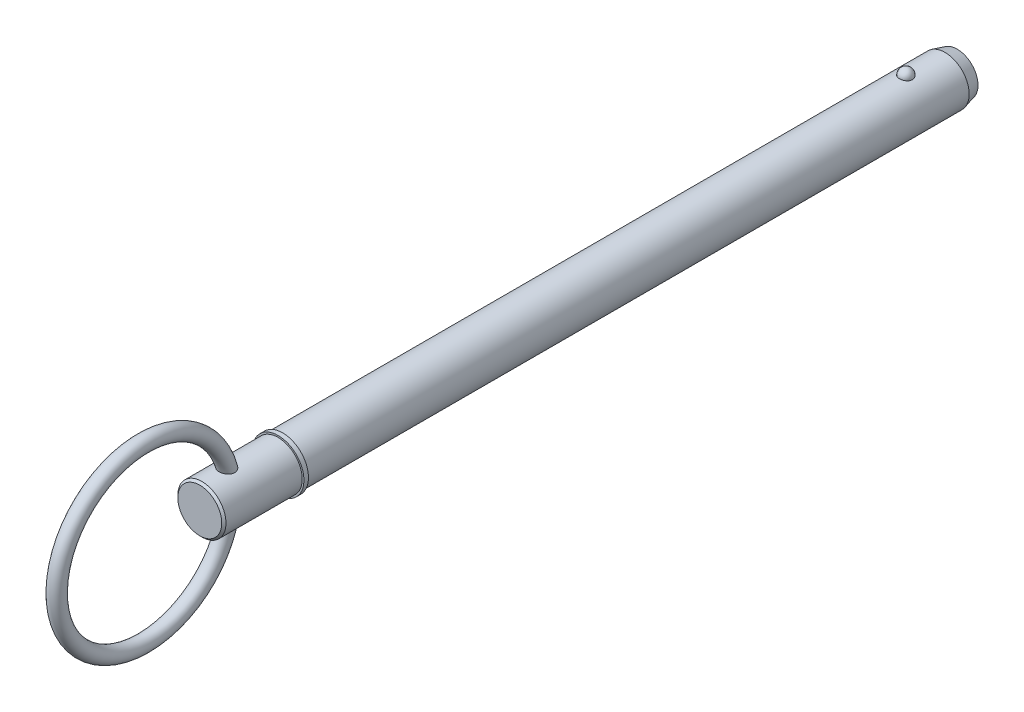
ISO-10303-21;
HEADER;
FILE_DESCRIPTION(('STEP AP214'),'2;1');
FILE_NAME('part.step','',(''),(''),'','','');
FILE_SCHEMA(('AUTOMOTIVE_DESIGN { 1 0 10303 214 1 1 1 1 }'));
ENDSEC;
DATA;
#1=APPLICATION_CONTEXT('core data for automotive mechanical design processes');
#2=APPLICATION_PROTOCOL_DEFINITION('international standard','automotive_design',2000,#1);
#3=PRODUCT_CONTEXT('',#1,'mechanical');
#4=PRODUCT('Part','Part','',(#3));
#5=PRODUCT_RELATED_PRODUCT_CATEGORY('part','',(#4));
#6=PRODUCT_DEFINITION_FORMATION('','',#4);
#7=PRODUCT_DEFINITION_CONTEXT('part definition',#1,'design');
#8=PRODUCT_DEFINITION('design','',#6,#7);
#9=PRODUCT_DEFINITION_SHAPE('','',#8);
#10=(LENGTH_UNIT() NAMED_UNIT(*) SI_UNIT(.MILLI.,.METRE.));
#11=(NAMED_UNIT(*) PLANE_ANGLE_UNIT() SI_UNIT($,.RADIAN.));
#12=(NAMED_UNIT(*) SI_UNIT($,.STERADIAN.) SOLID_ANGLE_UNIT());
#13=UNCERTAINTY_MEASURE_WITH_UNIT(LENGTH_MEASURE(1.E-05),#10,'distance_accuracy_value','');
#14=(GEOMETRIC_REPRESENTATION_CONTEXT(3) GLOBAL_UNCERTAINTY_ASSIGNED_CONTEXT((#13)) GLOBAL_UNIT_ASSIGNED_CONTEXT((#10,
#11,#12)) REPRESENTATION_CONTEXT('',''));
#15=CARTESIAN_POINT('',(0.,0.,0.));
#16=DIRECTION('',(0.,0.,1.));
#17=DIRECTION('',(1.,0.,0.));
#18=AXIS2_PLACEMENT_3D('',#15,#16,#17);
#19=CARTESIAN_POINT('',(0.,0.,203.2));
#20=DIRECTION('',(0.,0.,-1.));
#21=DIRECTION('',(-1.,0.,0.));
#22=AXIS2_PLACEMENT_3D('',#19,#20,#21);
#23=CYLINDRICAL_SURFACE('',#22,7.94);
#24=CARTESIAN_POINT('',(2.13020349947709,7.64891057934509,-2.14999999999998));
#25=CARTESIAN_POINT('',(2.1302012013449,7.64891247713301,-2.02978166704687));
#26=CARTESIAN_POINT('',(2.12037546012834,7.65166842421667,-1.90953383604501));
#27=CARTESIAN_POINT('',(2.08130792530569,7.66238579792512,-1.67243962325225));
#28=CARTESIAN_POINT('',(2.05205785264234,7.67034944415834,-1.55559471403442));
#29=CARTESIAN_POINT('',(1.97489181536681,7.69057749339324,-1.32869361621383));
#30=CARTESIAN_POINT('',(1.92698409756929,7.70283999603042,-1.218634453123));
#31=CARTESIAN_POINT('',(1.81370645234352,7.73029430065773,-1.00831338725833));
#32=CARTESIAN_POINT('',(1.74833715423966,7.7454859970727,-0.908051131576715));
#33=CARTESIAN_POINT('',(1.60144242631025,7.77718699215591,-0.719628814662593));
#34=CARTESIAN_POINT('',(1.51984382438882,7.7937020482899,-0.631526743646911));
#35=CARTESIAN_POINT('',(1.34279837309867,7.82614685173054,-0.470411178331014));
#36=CARTESIAN_POINT('',(1.24735148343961,7.84207659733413,-0.397397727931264));
#37=CARTESIAN_POINT('',(1.04544839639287,7.87153116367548,-0.268681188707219));
#38=CARTESIAN_POINT('',(0.939022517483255,7.88506234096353,-0.212932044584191));
#39=CARTESIAN_POINT('',(0.717931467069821,7.90825597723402,-0.120080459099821));
#40=CARTESIAN_POINT('',(0.603267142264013,7.9179188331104,-0.0829761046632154));
#41=CARTESIAN_POINT('',(0.371015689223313,7.93216561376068,-0.0289596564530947));
#42=CARTESIAN_POINT('',(0.253510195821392,7.93683225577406,-0.0117183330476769));
#43=CARTESIAN_POINT('',(0.0171784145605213,7.94086051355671,0.00318921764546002));
#44=CARTESIAN_POINT('',(-0.101647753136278,7.94022260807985,0.000857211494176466));
#45=CARTESIAN_POINT('',(-0.335567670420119,7.93375751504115,-0.0231465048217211));
#46=CARTESIAN_POINT('',(-0.450690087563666,7.92799987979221,-0.0445590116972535));
#47=CARTESIAN_POINT('',(-0.675610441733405,7.91200792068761,-0.105760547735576));
#48=CARTESIAN_POINT('',(-0.785408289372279,7.90177352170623,-0.145549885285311));
#49=CARTESIAN_POINT('',(-0.9972706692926,7.87784802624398,-0.242675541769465));
#50=CARTESIAN_POINT('',(-1.0992893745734,7.86413823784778,-0.300107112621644));
#51=CARTESIAN_POINT('',(-1.29223659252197,7.83474718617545,-0.430887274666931));
#52=CARTESIAN_POINT('',(-1.38316404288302,7.81906573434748,-0.50423738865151));
#53=CARTESIAN_POINT('',(-1.55313516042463,7.78710451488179,-0.666358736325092));
#54=CARTESIAN_POINT('',(-1.63193689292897,7.77081906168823,-0.755382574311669));
#55=CARTESIAN_POINT('',(-1.77366356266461,7.73970270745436,-0.945507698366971));
#56=CARTESIAN_POINT('',(-1.83658745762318,7.72487190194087,-1.04660977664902));
#57=CARTESIAN_POINT('',(-1.94556640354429,7.6981535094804,-1.2592768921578));
#58=CARTESIAN_POINT('',(-1.99143480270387,7.6862989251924,-1.37094182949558));
#59=CARTESIAN_POINT('',(-2.06418311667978,7.66708387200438,-1.6006615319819));
#60=CARTESIAN_POINT('',(-2.0910635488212,7.65972328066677,-1.71871612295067));
#61=CARTESIAN_POINT('',(-2.12508507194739,7.65035479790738,-1.95736076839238));
#62=CARTESIAN_POINT('',(-2.13230490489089,7.64832555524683,-2.07793875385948));
#63=CARTESIAN_POINT('',(-2.12704767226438,7.64978921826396,-2.31862835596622));
#64=CARTESIAN_POINT('',(-2.1145710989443,7.6532819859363,-2.4387399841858));
#65=CARTESIAN_POINT('',(-2.07034166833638,7.66536368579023,-2.6745168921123));
#66=CARTESIAN_POINT('',(-2.03867758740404,7.67392914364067,-2.79020005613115));
#67=CARTESIAN_POINT('',(-1.95694065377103,7.69517736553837,-3.014466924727));
#68=CARTESIAN_POINT('',(-1.90686710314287,7.70786028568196,-3.12305035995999));
#69=CARTESIAN_POINT('',(-1.78925555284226,7.73600831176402,-3.33065971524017));
#70=CARTESIAN_POINT('',(-1.72162904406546,7.75148739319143,-3.42963360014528));
#71=CARTESIAN_POINT('',(-1.57074739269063,7.78346215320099,-3.61466914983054));
#72=CARTESIAN_POINT('',(-1.48749169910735,7.79995786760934,-3.70073035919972));
#73=CARTESIAN_POINT('',(-1.30720250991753,7.83219119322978,-3.85783594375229));
#74=CARTESIAN_POINT('',(-1.2101234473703,7.84792605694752,-3.92882863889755));
#75=CARTESIAN_POINT('',(-1.00503150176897,7.87681523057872,-4.05342383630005));
#76=CARTESIAN_POINT('',(-0.897019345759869,7.88996971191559,-4.10702749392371));
#77=CARTESIAN_POINT('',(-0.674439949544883,7.91208451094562,-4.1947773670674));
#78=CARTESIAN_POINT('',(-0.55996501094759,7.92109245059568,-4.22914554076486));
#79=CARTESIAN_POINT('',(-0.326625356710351,7.93413878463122,-4.27838865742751));
#80=CARTESIAN_POINT('',(-0.20776113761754,7.93817773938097,-4.29326579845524));
#81=CARTESIAN_POINT('',(0.0287357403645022,7.94081322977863,-4.30300621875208));
#82=CARTESIAN_POINT('',(0.14635312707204,7.93950453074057,-4.2982179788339));
#83=CARTESIAN_POINT('',(0.379062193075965,7.93180098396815,-4.26955229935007));
#84=CARTESIAN_POINT('',(0.494153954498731,7.92540630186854,-4.24567548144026));
#85=CARTESIAN_POINT('',(0.718185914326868,7.90824874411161,-4.17962260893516));
#86=CARTESIAN_POINT('',(0.827145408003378,7.89750055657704,-4.13750805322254));
#87=CARTESIAN_POINT('',(1.03638036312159,7.87277755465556,-4.03615078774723));
#88=CARTESIAN_POINT('',(1.13665531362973,7.85880255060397,-3.97690707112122));
#89=CARTESIAN_POINT('',(1.32729731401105,7.82887859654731,-3.84189297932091));
#90=CARTESIAN_POINT('',(1.41749828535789,7.81290379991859,-3.76589388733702));
#91=CARTESIAN_POINT('',(1.58397257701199,7.78086330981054,-3.59992466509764));
#92=CARTESIAN_POINT('',(1.66024342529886,7.76479760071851,-3.50995206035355));
#93=CARTESIAN_POINT('',(1.79805631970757,7.73405928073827,-3.31688321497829));
#94=CARTESIAN_POINT('',(1.85933944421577,7.719413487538,-3.21359780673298));
#95=CARTESIAN_POINT('',(1.96397499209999,7.69345992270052,-2.99796163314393));
#96=CARTESIAN_POINT('',(2.00733488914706,7.68215076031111,-2.88561466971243));
#97=CARTESIAN_POINT('',(2.07068045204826,7.66529896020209,-2.66994136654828));
#98=CARTESIAN_POINT('',(2.09296296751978,7.65919990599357,-2.56732606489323));
#99=CARTESIAN_POINT('',(2.12272535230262,7.65100492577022,-2.35981463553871));
#100=CARTESIAN_POINT('',(2.13020550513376,7.64890892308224,-2.25491855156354));
#101=CARTESIAN_POINT('',(2.13020349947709,7.64891057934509,-2.14999999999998));
#102=B_SPLINE_CURVE_WITH_KNOTS('',3,(#24,#25,#26,#27,#28,#29,#30,#31,#32,#33,#34,#35,#36,#37,
#38,#39,#40,#41,#42,#43,#44,#45,#46,#47,#48,#49,#50,#51,#52,#53,#54,#55,#56,#57,#58,#59,#60,#61,
#62,#63,#64,#65,#66,#67,#68,#69,#70,#71,#72,#73,#74,#75,#76,#77,#78,#79,#80,#81,#82,#83,#84,#85,
#86,#87,#88,#89,#90,#91,#92,#93,#94,#95,#96,#97,#98,#99,#100,#101),.UNSPECIFIED.,.T.,.F.,(4,2,2,
2,2,2,2,2,2,2,2,2,2,2,2,2,2,2,2,2,2,2,2,2,2,2,2,2,2,2,2,2,2,2,2,2,2,2,4),(0.,0.360277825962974,
0.720709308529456,1.0809816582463,1.44124102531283,1.80316307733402,2.16508618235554,
2.52603531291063,2.88694740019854,3.24178717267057,3.59659491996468,3.94665496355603,
4.29672088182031,4.64871108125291,5.0007349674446,5.3590619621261,5.71741247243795,
6.079576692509,6.44173104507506,6.80243279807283,7.16312553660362,7.52216203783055,
7.88121215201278,8.24210915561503,8.60301888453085,8.96514709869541,9.32725124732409,
9.68508606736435,10.0428805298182,10.3943622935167,10.7458326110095,11.0961268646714,
11.4464417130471,11.8018724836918,12.1573662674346,12.5186252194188,12.8797333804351,
13.1941658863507,13.5085923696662),.UNSPECIFIED.);
#103=CARTESIAN_POINT('',(2.13020349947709,7.64891057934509,-2.14999999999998));
#104=VERTEX_POINT('',#103);
#105=EDGE_CURVE('E102',#104,#104,#102,.T.);
#106=ORIENTED_EDGE('',*,*,#105,.T.);
#107=EDGE_LOOP('',(#106));
#108=FACE_BOUND('',#107,.T.);
#109=CARTESIAN_POINT('',(0.,0.,-15.0499999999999));
#110=DIRECTION('',(0.,0.,-1.));
#111=DIRECTION('',(-1.,0.,0.));
#112=AXIS2_PLACEMENT_3D('',#109,#110,#111);
#113=CIRCLE('',#112,7.94);
#114=CARTESIAN_POINT('',(-7.94,0.,-15.0499999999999));
#115=VERTEX_POINT('',#114);
#116=EDGE_CURVE('E110',#115,#115,#113,.F.);
#117=ORIENTED_EDGE('',*,*,#116,.T.);
#118=EDGE_LOOP('',(#117));
#119=FACE_BOUND('',#118,.T.);
#120=CARTESIAN_POINT('',(0.,0.,203.2));
#121=DIRECTION('',(0.,0.,1.));
#122=DIRECTION('',(1.,0.,0.));
#123=AXIS2_PLACEMENT_3D('',#120,#121,#122);
#124=CIRCLE('',#123,7.94);
#125=CARTESIAN_POINT('',(7.94,0.,203.2));
#126=VERTEX_POINT('',#125);
#127=EDGE_CURVE('E108',#126,#126,#124,.T.);
#128=ORIENTED_EDGE('',*,*,#127,.F.);
#129=EDGE_LOOP('',(#128));
#130=FACE_BOUND('',#129,.T.);
#131=ADVANCED_FACE('F39',(#108,#119,#130),#23,.T.);
#132=CARTESIAN_POINT('',(0.,0.,-19.05));
#133=DIRECTION('',(0.,0.,-1.));
#134=DIRECTION('',(-1.,0.,0.));
#135=AXIS2_PLACEMENT_3D('',#132,#133,#134);
#136=PLANE('',#135);
#137=CARTESIAN_POINT('',(0.,0.,-19.05));
#138=DIRECTION('',(0.,0.,-1.));
#139=DIRECTION('',(-1.,0.,0.));
#140=AXIS2_PLACEMENT_3D('',#137,#138,#139);
#141=CIRCLE('',#140,6.8682032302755);
#142=CARTESIAN_POINT('',(-6.8682032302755,0.,-19.05));
#143=VERTEX_POINT('',#142);
#144=EDGE_CURVE('E142',#143,#143,#141,.T.);
#145=ORIENTED_EDGE('',*,*,#144,.T.);
#146=EDGE_LOOP('',(#145));
#147=FACE_BOUND('',#146,.T.);
#148=ADVANCED_FACE('F88',(#147),#136,.T.);
#149=CARTESIAN_POINT('',(0.,0.,-19.05));
#150=DIRECTION('',(0.,0.,1.));
#151=DIRECTION('',(1.,0.,0.));
#152=AXIS2_PLACEMENT_3D('',#149,#150,#151);
#153=CONICAL_SURFACE('',#152,6.8682032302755,0.261799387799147);
#154=ORIENTED_EDGE('',*,*,#116,.F.);
#155=EDGE_LOOP('',(#154));
#156=FACE_BOUND('',#155,.T.);
#157=ORIENTED_EDGE('',*,*,#144,.F.);
#158=EDGE_LOOP('',(#157));
#159=FACE_BOUND('',#158,.T.);
#160=ADVANCED_FACE('F94',(#156,#159),#153,.T.);
#161=CARTESIAN_POINT('',(0.,7.94,-2.14999999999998));
#162=DIRECTION('',(0.,1.,0.));
#163=DIRECTION('',(0.,0.,-1.));
#164=AXIS2_PLACEMENT_3D('',#161,#162,#163);
#165=SPHERICAL_SURFACE('',#164,2.15);
#166=ORIENTED_EDGE('',*,*,#105,.F.);
#167=EDGE_LOOP('',(#166));
#168=FACE_BOUND('',#167,.T.);
#169=ADVANCED_FACE('F113',(#168),#165,.T.);
#170=CARTESIAN_POINT('',(0.,0.,203.2));
#171=DIRECTION('',(0.,0.,-1.));
#172=DIRECTION('',(-1.,0.,0.));
#173=AXIS2_PLACEMENT_3D('',#170,#171,#172);
#174=PLANE('',#173);
#175=ORIENTED_EDGE('',*,*,#127,.T.);
#176=EDGE_LOOP('',(#175));
#177=FACE_BOUND('',#176,.T.);
#178=CARTESIAN_POINT('',(0.,0.,203.2));
#179=DIRECTION('',(0.,0.,-1.));
#180=DIRECTION('',(-1.,0.,0.));
#181=AXIS2_PLACEMENT_3D('',#178,#179,#180);
#182=CIRCLE('',#181,8.5);
#183=CARTESIAN_POINT('',(-8.5,0.,203.2));
#184=VERTEX_POINT('',#183);
#185=EDGE_CURVE('E109',#184,#184,#182,.T.);
#186=ORIENTED_EDGE('',*,*,#185,.T.);
#187=EDGE_LOOP('',(#186));
#188=FACE_BOUND('',#187,.T.);
#189=ADVANCED_FACE('F117',(#177,#188),#174,.T.);
#190=CARTESIAN_POINT('',(0.,0.,33.7287874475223));
#191=DIRECTION('',(0.,0.,-1.));
#192=DIRECTION('',(-1.,0.,0.));
#193=AXIS2_PLACEMENT_3D('',#190,#191,#192);
#194=CYLINDRICAL_SURFACE('',#193,8.5);
#195=CARTESIAN_POINT('',(0.,0.,204.7));
#196=DIRECTION('',(0.,0.,-1.));
#197=DIRECTION('',(-1.,0.,0.));
#198=AXIS2_PLACEMENT_3D('',#195,#196,#197);
#199=CIRCLE('',#198,8.5);
#200=CARTESIAN_POINT('',(-8.5,0.,204.7));
#201=VERTEX_POINT('',#200);
#202=EDGE_CURVE('E134',#201,#201,#199,.T.);
#203=ORIENTED_EDGE('',*,*,#202,.T.);
#204=EDGE_LOOP('',(#203));
#205=FACE_BOUND('',#204,.T.);
#206=ORIENTED_EDGE('',*,*,#185,.F.);
#207=EDGE_LOOP('',(#206));
#208=FACE_BOUND('',#207,.T.);
#209=ADVANCED_FACE('F121',(#205,#208),#194,.T.);
#210=CARTESIAN_POINT('',(0.,8.5,204.7));
#211=DIRECTION('',(0.,0.,1.));
#212=DIRECTION('',(1.,0.,0.));
#213=AXIS2_PLACEMENT_3D('',#210,#211,#212);
#214=PLANE('',#213);
#215=CARTESIAN_POINT('',(0.,0.,204.7));
#216=DIRECTION('',(0.,0.,1.));
#217=DIRECTION('',(1.,0.,0.));
#218=AXIS2_PLACEMENT_3D('',#215,#216,#217);
#219=CIRCLE('',#218,7.94);
#220=CARTESIAN_POINT('',(7.94,0.,204.7));
#221=VERTEX_POINT('',#220);
#222=EDGE_CURVE('E112',#221,#221,#219,.T.);
#223=ORIENTED_EDGE('',*,*,#222,.F.);
#224=EDGE_LOOP('',(#223));
#225=FACE_BOUND('',#224,.T.);
#226=ORIENTED_EDGE('',*,*,#202,.F.);
#227=EDGE_LOOP('',(#226));
#228=FACE_BOUND('',#227,.T.);
#229=ADVANCED_FACE('F85',(#225,#228),#214,.T.);
#230=CARTESIAN_POINT('',(0.,0.,230.51));
#231=DIRECTION('',(0.,0.,-1.));
#232=DIRECTION('',(-1.,0.,0.));
#233=AXIS2_PLACEMENT_3D('',#230,#231,#232);
#234=CYLINDRICAL_SURFACE('',#233,7.94);
#235=CARTESIAN_POINT('',(-1.15544091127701,-7.85547938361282,219.311910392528));
#236=CARTESIAN_POINT('',(-1.03089695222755,-7.87379554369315,219.249615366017));
#237=CARTESIAN_POINT('',(-0.900845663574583,-7.8898743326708,219.197593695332));
#238=CARTESIAN_POINT('',(-0.633417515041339,-7.91583465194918,219.115265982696));
#239=CARTESIAN_POINT('',(-0.496037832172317,-7.92571377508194,219.084968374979));
#240=CARTESIAN_POINT('',(-0.217881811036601,-7.93823020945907,219.046773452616));
#241=CARTESIAN_POINT('',(-0.0771057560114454,-7.94086812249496,219.038874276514));
#242=CARTESIAN_POINT('',(0.203828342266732,-7.93862624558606,219.045648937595));
#243=CARTESIAN_POINT('',(0.343986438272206,-7.93374711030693,219.060320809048));
#244=CARTESIAN_POINT('',(0.619544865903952,-7.9169944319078,219.111877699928));
#245=CARTESIAN_POINT('',(0.754950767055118,-7.9051293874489,219.148735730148));
#246=CARTESIAN_POINT('',(1.01737529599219,-7.8756583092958,219.243842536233));
#247=CARTESIAN_POINT('',(1.14439334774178,-7.85805188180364,219.302092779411));
#248=CARTESIAN_POINT('',(1.38668443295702,-7.81893907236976,219.438842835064));
#249=CARTESIAN_POINT('',(1.50193494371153,-7.79742542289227,219.517380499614));
#250=CARTESIAN_POINT('',(1.71711272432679,-7.75288428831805,219.692872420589));
#251=CARTESIAN_POINT('',(1.81704089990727,-7.72985689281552,219.789825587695));
#252=CARTESIAN_POINT('',(1.99787261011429,-7.68509802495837,219.99887149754));
#253=CARTESIAN_POINT('',(2.07893183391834,-7.66335713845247,220.110827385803));
#254=CARTESIAN_POINT('',(2.2207658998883,-7.62346723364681,220.347480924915));
#255=CARTESIAN_POINT('',(2.28154607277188,-7.6053172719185,220.472175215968));
#256=CARTESIAN_POINT('',(2.38011540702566,-7.57504217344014,220.727618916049));
#257=CARTESIAN_POINT('',(2.41840843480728,-7.56278621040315,220.858158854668));
#258=CARTESIAN_POINT('',(2.47363993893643,-7.54490265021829,221.124095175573));
#259=CARTESIAN_POINT('',(2.49057788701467,-7.53927521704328,221.259491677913));
#260=CARTESIAN_POINT('',(2.50351014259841,-7.53499042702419,221.53242871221));
#261=CARTESIAN_POINT('',(2.49933630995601,-7.53638902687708,221.669977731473));
#262=CARTESIAN_POINT('',(2.47072547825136,-7.54581524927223,221.942698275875));
#263=CARTESIAN_POINT('',(2.44628184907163,-7.55384504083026,222.077869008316));
#264=CARTESIAN_POINT('',(2.37589315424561,-7.57629160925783,222.353085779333));
#265=CARTESIAN_POINT('',(2.32844094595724,-7.5911515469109,222.49270896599));
#266=CARTESIAN_POINT('',(2.21332780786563,-7.62550828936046,222.762781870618));
#267=CARTESIAN_POINT('',(2.14565489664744,-7.64500784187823,222.893226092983));
#268=CARTESIAN_POINT('',(1.98438755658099,-7.68852412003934,223.153702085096));
#269=CARTESIAN_POINT('',(1.88896913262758,-7.71279219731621,223.282569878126));
#270=CARTESIAN_POINT('',(1.67743245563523,-7.7615471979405,223.522112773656));
#271=CARTESIAN_POINT('',(1.56130644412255,-7.78603420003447,223.632781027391));
#272=CARTESIAN_POINT('',(1.31168281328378,-7.83191501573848,223.830100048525));
#273=CARTESIAN_POINT('',(1.1784163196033,-7.85334315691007,223.917029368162));
#274=CARTESIAN_POINT('',(0.967442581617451,-7.88116219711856,224.026657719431));
#275=CARTESIAN_POINT('',(0.895283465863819,-7.88971376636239,224.059736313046));
#276=CARTESIAN_POINT('',(0.747777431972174,-7.90505596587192,224.118400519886));
#277=CARTESIAN_POINT('',(0.672431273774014,-7.91184701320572,224.143987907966));
#278=CARTESIAN_POINT('',(0.53057561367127,-7.92252382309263,224.183912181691));
#279=CARTESIAN_POINT('',(0.464394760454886,-7.92668987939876,224.199349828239));
#280=CARTESIAN_POINT('',(0.330815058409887,-7.9333870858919,224.224069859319));
#281=CARTESIAN_POINT('',(0.263416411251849,-7.93591850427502,224.23335325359));
#282=CARTESIAN_POINT('',(0.128041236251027,-7.93925585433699,224.245577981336));
#283=CARTESIAN_POINT('',(0.0600650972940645,-7.94006286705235,224.248523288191));
#284=CARTESIAN_POINT('',(-0.0758408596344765,-7.93992929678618,224.248033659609));
#285=CARTESIAN_POINT('',(-0.143770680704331,-7.93898884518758,224.244599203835));
#286=CARTESIAN_POINT('',(-0.330023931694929,-7.93402174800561,224.226406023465));
#287=CARTESIAN_POINT('',(-0.447720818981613,-7.92820264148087,224.205060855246));
#288=CARTESIAN_POINT('',(-0.677833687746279,-7.91185818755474,224.144093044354));
#289=CARTESIAN_POINT('',(-0.790248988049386,-7.90133223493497,224.104468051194));
#290=CARTESIAN_POINT('',(-1.01082100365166,-7.87620111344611,224.007436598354));
#291=CARTESIAN_POINT('',(-1.1187367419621,-7.86147932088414,223.949515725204));
#292=CARTESIAN_POINT('',(-1.32464461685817,-7.8294189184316,223.818755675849));
#293=CARTESIAN_POINT('',(-1.42263264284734,-7.81207923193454,223.745910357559));
#294=CARTESIAN_POINT('',(-1.62038324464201,-7.77363945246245,223.576536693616));
#295=CARTESIAN_POINT('',(-1.7184938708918,-7.75235190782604,223.478123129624));
#296=CARTESIAN_POINT('',(-1.89908721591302,-7.71010284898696,223.267783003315));
#297=CARTESIAN_POINT('',(-1.9815587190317,-7.68914157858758,223.155846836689));
#298=CARTESIAN_POINT('',(-2.13974270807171,-7.64674394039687,222.905108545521));
#299=CARTESIAN_POINT('',(-2.21304020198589,-7.62562536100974,222.764719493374));
#300=CARTESIAN_POINT('',(-2.33615659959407,-7.58881542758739,222.473266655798));
#301=CARTESIAN_POINT('',(-2.38596943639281,-7.57312547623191,222.322200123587));
#302=CARTESIAN_POINT('',(-2.46059473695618,-7.54921618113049,222.010492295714));
#303=CARTESIAN_POINT('',(-2.48494918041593,-7.54113395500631,221.849728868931));
#304=CARTESIAN_POINT('',(-2.50480773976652,-7.53456588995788,221.526244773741));
#305=CARTESIAN_POINT('',(-2.50033692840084,-7.53607171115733,221.363525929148));
#306=CARTESIAN_POINT('',(-2.46306926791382,-7.54832452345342,221.057165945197));
#307=CARTESIAN_POINT('',(-2.4329569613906,-7.55819528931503,220.913162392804));
#308=CARTESIAN_POINT('',(-2.34806892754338,-7.58499431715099,220.633304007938));
#309=CARTESIAN_POINT('',(-2.29330013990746,-7.60192059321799,220.497446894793));
#310=CARTESIAN_POINT('',(-2.16523724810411,-7.63933506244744,220.24765733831));
#311=CARTESIAN_POINT('',(-2.09353456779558,-7.65948502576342,220.132853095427));
#312=CARTESIAN_POINT('',(-1.93200913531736,-7.7018104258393,219.917268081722));
#313=CARTESIAN_POINT('',(-1.842192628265,-7.72398516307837,219.816482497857));
#314=CARTESIAN_POINT('',(-1.65746337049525,-7.76558957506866,219.64131484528));
#315=CARTESIAN_POINT('',(-1.56413624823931,-7.78505810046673,219.565259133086));
#316=CARTESIAN_POINT('',(-1.36706423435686,-7.82207051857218,219.42753576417));
#317=CARTESIAN_POINT('',(-1.26331856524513,-7.83961426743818,219.365869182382));
#318=CARTESIAN_POINT('',(-1.15544091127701,-7.85547938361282,219.311910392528));
#319=B_SPLINE_CURVE_WITH_KNOTS('',3,(#235,#236,#237,#238,#239,#240,#241,#242,#243,#244,#245,
#246,#247,#248,#249,#250,#251,#252,#253,#254,#255,#256,#257,#258,#259,#260,#261,#262,#263,#264,
#265,#266,#267,#268,#269,#270,#271,#272,#273,#274,#275,#276,#277,#278,#279,#280,#281,#282,#283,
#284,#285,#286,#287,#288,#289,#290,#291,#292,#293,#294,#295,#296,#297,#298,#299,#300,#301,#302,
#303,#304,#305,#306,#307,#308,#309,#310,#311,#312,#313,#314,#315,#316,#317,#318),.UNSPECIFIED.,
.T.,.F.,(4,2,2,2,2,2,2,2,2,2,2,2,2,2,2,2,2,2,2,2,2,2,2,2,2,2,2,2,2,2,2,2,2,2,2,2,2,2,2,2,2,4),
(0.,0.420927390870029,0.842018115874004,1.26307384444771,1.68409290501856,2.10460083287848,
2.52513760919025,2.94646475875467,3.36776699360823,3.7854589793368,4.20304108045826,
4.61086922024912,5.01870744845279,5.42979890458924,5.84102487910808,6.28383316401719,
6.72690434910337,7.21113455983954,7.6955465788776,8.17400305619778,8.41316278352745,
8.65226580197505,8.85622998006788,9.06016068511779,9.26396350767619,9.4677510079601,
9.8252104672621,10.1827159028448,10.5513335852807,10.9201032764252,11.3402098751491,
11.7606166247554,12.2377707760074,12.715048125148,13.2007716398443,13.6860727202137,
14.1260485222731,14.5659005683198,14.9745225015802,15.3830037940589,15.7475760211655,
16.1121754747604),.UNSPECIFIED.);
#320=CARTESIAN_POINT('',(-1.15544091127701,-7.85547938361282,219.311910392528));
#321=VERTEX_POINT('',#320);
#322=EDGE_CURVE('E10',#321,#321,#319,.T.);
#323=ORIENTED_EDGE('',*,*,#322,.F.);
#324=EDGE_LOOP('',(#323));
#325=FACE_BOUND('',#324,.T.);
#326=CARTESIAN_POINT('',(-1.15544091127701,7.85547938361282,219.311910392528));
#327=CARTESIAN_POINT('',(-1.278579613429,7.83736699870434,219.373507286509));
#328=CARTESIAN_POINT('',(-1.39638360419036,7.8170599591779,219.445172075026));
#329=CARTESIAN_POINT('',(-1.61803025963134,7.77421032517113,219.60708252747));
#330=CARTESIAN_POINT('',(-1.72186951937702,7.7516671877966,219.697332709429));
#331=CARTESIAN_POINT('',(-1.91269683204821,7.70680387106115,219.894395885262));
#332=CARTESIAN_POINT('',(-1.99967065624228,7.68448389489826,220.001222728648));
#333=CARTESIAN_POINT('',(-2.15412555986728,7.64262858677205,220.228607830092));
#334=CARTESIAN_POINT('',(-2.22161184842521,7.62309251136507,220.349162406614));
#335=CARTESIAN_POINT('',(-2.3342927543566,7.5893410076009,220.598377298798));
#336=CARTESIAN_POINT('',(-2.3798562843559,7.57503857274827,220.726859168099));
#337=CARTESIAN_POINT('',(-2.44955571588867,7.55278941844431,220.990011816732));
#338=CARTESIAN_POINT('',(-2.47369226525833,7.544842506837,221.12468240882));
#339=CARTESIAN_POINT('',(-2.50059611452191,7.53596831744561,221.396137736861));
#340=CARTESIAN_POINT('',(-2.50339277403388,7.53503139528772,221.532919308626));
#341=CARTESIAN_POINT('',(-2.48855779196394,7.53994222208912,221.805224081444));
#342=CARTESIAN_POINT('',(-2.47092012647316,7.54579197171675,221.94074689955));
#343=CARTESIAN_POINT('',(-2.41469361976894,7.56397908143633,222.216293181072));
#344=CARTESIAN_POINT('',(-2.37479606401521,7.57671999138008,222.35602135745));
#345=CARTESIAN_POINT('',(-2.27489955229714,7.60730881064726,222.627515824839));
#346=CARTESIAN_POINT('',(-2.2148900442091,7.6251594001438,222.759277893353));
#347=CARTESIAN_POINT('',(-2.06943931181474,7.66598084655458,223.02452508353));
#348=CARTESIAN_POINT('',(-1.98208275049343,7.68928197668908,223.156914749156));
#349=CARTESIAN_POINT('',(-1.78658869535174,7.73704343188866,223.405235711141));
#350=CARTESIAN_POINT('',(-1.67843905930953,7.76150442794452,223.521157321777));
#351=CARTESIAN_POINT('',(-1.44142605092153,7.80900750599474,223.733699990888));
#352=CARTESIAN_POINT('',(-1.31231821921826,7.83202775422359,223.830058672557));
#353=CARTESIAN_POINT('',(-1.10627655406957,7.86286215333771,223.954614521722));
#354=CARTESIAN_POINT('',(-1.03552563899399,7.87252500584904,223.992805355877));
#355=CARTESIAN_POINT('',(-0.890375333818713,7.89025728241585,224.061885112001));
#356=CARTESIAN_POINT('',(-0.815978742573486,7.89832790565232,224.092779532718));
#357=CARTESIAN_POINT('',(-0.674180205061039,7.91160332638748,224.143082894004));
#358=CARTESIAN_POINT('',(-0.607145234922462,7.91704543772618,224.163468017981));
#359=CARTESIAN_POINT('',(-0.471385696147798,7.92628663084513,224.197876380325));
#360=CARTESIAN_POINT('',(-0.402662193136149,7.93008672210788,224.211903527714));
#361=CARTESIAN_POINT('',(-0.264153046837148,7.9359070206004,224.233322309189));
#362=CARTESIAN_POINT('',(-0.194368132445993,7.9379283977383,224.240718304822));
#363=CARTESIAN_POINT('',(-0.0544054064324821,7.94012285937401,224.248743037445));
#364=CARTESIAN_POINT('',(0.0157723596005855,7.94029615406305,224.249372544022));
#365=CARTESIAN_POINT('',(0.206295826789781,7.93822912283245,224.241825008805));
#366=CARTESIAN_POINT('',(0.326425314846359,7.93416340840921,224.226989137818));
#367=CARTESIAN_POINT('',(0.562310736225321,7.92094769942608,224.178077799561));
#368=CARTESIAN_POINT('',(0.67806631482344,7.91179729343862,224.14400077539));
#369=CARTESIAN_POINT('',(0.903029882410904,7.88929555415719,224.058269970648));
#370=CARTESIAN_POINT('',(1.01220356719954,7.87592415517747,224.006532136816));
#371=CARTESIAN_POINT('',(1.22142047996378,7.84620431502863,223.887793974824));
#372=CARTESIAN_POINT('',(1.32146048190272,7.82985482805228,223.820788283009));
#373=CARTESIAN_POINT('',(1.52328754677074,7.7932678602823,223.664309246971));
#374=CARTESIAN_POINT('',(1.62365085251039,7.77280069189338,223.573056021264));
#375=CARTESIAN_POINT('',(1.80985117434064,7.73156849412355,223.376815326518));
#376=CARTESIAN_POINT('',(1.895678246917,7.71080327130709,223.27181854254));
#377=CARTESIAN_POINT('',(2.06302404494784,7.66785771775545,223.034543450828));
#378=CARTESIAN_POINT('',(2.14213178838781,7.64590590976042,222.900514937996));
#379=CARTESIAN_POINT('',(2.27825755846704,7.60645646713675,222.620994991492));
#380=CARTESIAN_POINT('',(2.33526577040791,7.58896081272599,222.475498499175));
#381=CARTESIAN_POINT('',(2.42707573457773,7.56011538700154,222.170242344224));
#382=CARTESIAN_POINT('',(2.4608459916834,7.54905411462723,222.010140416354));
#383=CARTESIAN_POINT('',(2.49980168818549,7.53624914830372,221.686129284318));
#384=CARTESIAN_POINT('',(2.50500938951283,7.5344981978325,221.522223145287));
#385=CARTESIAN_POINT('',(2.48594104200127,7.54080673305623,221.209976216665));
#386=CARTESIAN_POINT('',(2.46407777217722,7.54806351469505,221.061473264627));
#387=CARTESIAN_POINT('',(2.3945479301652,7.57040718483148,220.771258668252));
#388=CARTESIAN_POINT('',(2.34689355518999,7.58549037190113,220.629543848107));
#389=CARTESIAN_POINT('',(2.2318274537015,7.62009243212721,220.369141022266));
#390=CARTESIAN_POINT('',(2.16637710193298,7.63914093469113,220.249517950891));
#391=CARTESIAN_POINT('',(2.01638736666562,7.68009146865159,220.02346099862));
#392=CARTESIAN_POINT('',(1.93184850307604,7.7019934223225,219.917026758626));
#393=CARTESIAN_POINT('',(1.74664202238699,7.74608439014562,219.72066977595));
#394=CARTESIAN_POINT('',(1.646079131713,7.76827073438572,219.63064744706));
#395=CARTESIAN_POINT('',(1.43119791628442,7.81071401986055,219.468308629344));
#396=CARTESIAN_POINT('',(1.31687846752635,7.83097080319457,219.395993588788));
#397=CARTESIAN_POINT('',(1.07477437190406,7.86789551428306,219.269149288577));
#398=CARTESIAN_POINT('',(0.946739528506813,7.88446964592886,219.215069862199));
#399=CARTESIAN_POINT('',(0.683029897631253,7.91167708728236,219.128213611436));
#400=CARTESIAN_POINT('',(0.54735441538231,7.92230985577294,219.095438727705));
#401=CARTESIAN_POINT('',(0.271066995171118,7.93658630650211,219.051730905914));
#402=CARTESIAN_POINT('',(0.13042455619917,7.94017418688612,219.040972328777));
#403=CARTESIAN_POINT('',(-0.150736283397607,7.93981282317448,219.042062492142));
#404=CARTESIAN_POINT('',(-0.291254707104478,7.93586558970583,219.053905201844));
#405=CARTESIAN_POINT('',(-0.556023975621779,7.92151946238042,219.097891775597));
#406=CARTESIAN_POINT('',(-0.68062174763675,7.91171585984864,219.128166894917));
#407=CARTESIAN_POINT('',(-0.923476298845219,7.88705844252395,219.206736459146));
#408=CARTESIAN_POINT('',(-1.04173303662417,7.87220459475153,219.255031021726));
#409=CARTESIAN_POINT('',(-1.15544091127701,7.85547938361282,219.311910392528));
#410=B_SPLINE_CURVE_WITH_KNOTS('',3,(#326,#327,#328,#329,#330,#331,#332,#333,#334,#335,#336,
#337,#338,#339,#340,#341,#342,#343,#344,#345,#346,#347,#348,#349,#350,#351,#352,#353,#354,#355,
#356,#357,#358,#359,#360,#361,#362,#363,#364,#365,#366,#367,#368,#369,#370,#371,#372,#373,#374,
#375,#376,#377,#378,#379,#380,#381,#382,#383,#384,#385,#386,#387,#388,#389,#390,#391,#392,#393,
#394,#395,#396,#397,#398,#399,#400,#401,#402,#403,#404,#405,#406,#407,#408,#409),.UNSPECIFIED.,
.T.,.F.,(4,2,2,2,2,2,2,2,2,2,2,2,2,2,2,2,2,2,2,2,2,2,2,2,2,2,2,2,2,2,2,2,2,2,2,2,2,2,2,2,2,4),
(0.,0.416167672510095,0.832436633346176,1.24905527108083,1.66556244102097,2.07479168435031,
2.48400855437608,2.89266231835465,3.30143658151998,3.73725068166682,4.17329379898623,
4.65204873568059,5.13108409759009,5.61617224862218,5.85876072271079,6.10116578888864,
6.31168904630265,6.52208269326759,6.73233785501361,6.9425691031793,7.30398888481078,
7.66543791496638,8.02863174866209,8.39195337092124,8.801906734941,9.21213940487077,
9.68159903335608,10.1512669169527,10.6406305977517,11.1296128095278,11.5779838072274,
12.0261429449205,12.4372146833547,12.8482752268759,13.256751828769,13.6652618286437,
14.0832160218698,14.5012082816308,14.9224982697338,15.3436758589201,15.72796797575,
16.1122626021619),.UNSPECIFIED.);
#411=CARTESIAN_POINT('',(-1.15544091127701,7.85547938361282,219.311910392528));
#412=VERTEX_POINT('',#411);
#413=EDGE_CURVE('E51',#412,#412,#410,.T.);
#414=ORIENTED_EDGE('',*,*,#413,.F.);
#415=EDGE_LOOP('',(#414));
#416=FACE_BOUND('',#415,.T.);
#417=CARTESIAN_POINT('',(0.,0.,229.81));
#418=DIRECTION('',(0.,0.,-1.));
#419=DIRECTION('',(-1.,0.,0.));
#420=AXIS2_PLACEMENT_3D('',#417,#418,#419);
#421=CIRCLE('',#420,7.94);
#422=CARTESIAN_POINT('',(-7.94,0.,229.81));
#423=VERTEX_POINT('',#422);
#424=EDGE_CURVE('E64',#423,#423,#421,.T.);
#425=ORIENTED_EDGE('',*,*,#424,.T.);
#426=EDGE_LOOP('',(#425));
#427=FACE_BOUND('',#426,.T.);
#428=ORIENTED_EDGE('',*,*,#222,.T.);
#429=EDGE_LOOP('',(#428));
#430=FACE_BOUND('',#429,.T.);
#431=ADVANCED_FACE('F69',(#325,#416,#427,#430),#234,.T.);
#432=CARTESIAN_POINT('',(0.,0.,230.51));
#433=DIRECTION('',(0.,0.,-1.));
#434=DIRECTION('',(-1.,0.,0.));
#435=AXIS2_PLACEMENT_3D('',#432,#433,#434);
#436=PLANE('',#435);
#437=CARTESIAN_POINT('',(0.,0.,230.51));
#438=DIRECTION('',(0.,0.,-1.));
#439=DIRECTION('',(-1.,0.,0.));
#440=AXIS2_PLACEMENT_3D('',#437,#438,#439);
#441=CIRCLE('',#440,7.23999999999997);
#442=CARTESIAN_POINT('',(-7.23999999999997,0.,230.51));
#443=VERTEX_POINT('',#442);
#444=EDGE_CURVE('E58',#443,#443,#441,.F.);
#445=ORIENTED_EDGE('',*,*,#444,.T.);
#446=EDGE_LOOP('',(#445));
#447=FACE_BOUND('',#446,.T.);
#448=ADVANCED_FACE('F76',(#447),#436,.F.);
#449=CARTESIAN_POINT('',(0.,0.,229.81));
#450=DIRECTION('',(0.,0.,-1.));
#451=DIRECTION('',(-1.,0.,0.));
#452=AXIS2_PLACEMENT_3D('',#449,#450,#451);
#453=CONICAL_SURFACE('',#452,7.94,0.785398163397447);
#454=ORIENTED_EDGE('',*,*,#444,.F.);
#455=EDGE_LOOP('',(#454));
#456=FACE_BOUND('',#455,.T.);
#457=ORIENTED_EDGE('',*,*,#424,.F.);
#458=EDGE_LOOP('',(#457));
#459=FACE_BOUND('',#458,.T.);
#460=ADVANCED_FACE('F41',(#456,#459),#453,.T.);
#461=CARTESIAN_POINT('',(0.,0.,249.085));
#462=DIRECTION('',(1.,0.,0.));
#463=DIRECTION('',(0.,0.,-1.));
#464=AXIS2_PLACEMENT_3D('',#461,#462,#463);
#465=TOROIDAL_SURFACE('',#464,28.575,2.5);
#466=ORIENTED_EDGE('',*,*,#322,.T.);
#467=EDGE_LOOP('',(#466));
#468=FACE_BOUND('',#467,.T.);
#469=ORIENTED_EDGE('',*,*,#413,.T.);
#470=EDGE_LOOP('',(#469));
#471=FACE_BOUND('',#470,.T.);
#472=ADVANCED_FACE('F73',(#468,#471),#465,.T.);
#473=CLOSED_SHELL('',(#131,#148,#160,#169,#189,#209,#229,#431,#448,#460,#472));
#474=MANIFOLD_SOLID_BREP('B2',#473);
#475=ADVANCED_BREP_SHAPE_REPRESENTATION('',(#18,#474),#14);
#476=SHAPE_DEFINITION_REPRESENTATION(#9,#475);
ENDSEC;
END-ISO-10303-21;
